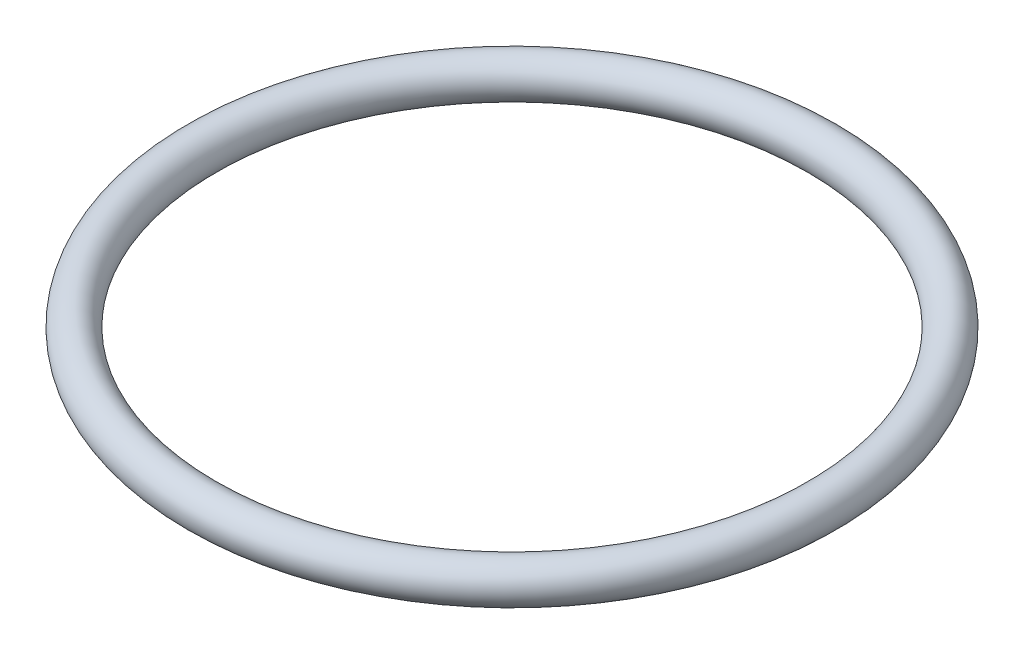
ISO-10303-21;
HEADER;
FILE_DESCRIPTION(('STEP AP214'),'2;1');
FILE_NAME('part.step','',(''),(''),'','','');
FILE_SCHEMA(('AUTOMOTIVE_DESIGN { 1 0 10303 214 1 1 1 1 }'));
ENDSEC;
DATA;
#1=APPLICATION_CONTEXT('core data for automotive mechanical design processes');
#2=APPLICATION_PROTOCOL_DEFINITION('international standard','automotive_design',2000,#1);
#3=PRODUCT_CONTEXT('',#1,'mechanical');
#4=PRODUCT('Part','Part','',(#3));
#5=PRODUCT_RELATED_PRODUCT_CATEGORY('part','',(#4));
#6=PRODUCT_DEFINITION_FORMATION('','',#4);
#7=PRODUCT_DEFINITION_CONTEXT('part definition',#1,'design');
#8=PRODUCT_DEFINITION('design','',#6,#7);
#9=PRODUCT_DEFINITION_SHAPE('','',#8);
#10=(LENGTH_UNIT() NAMED_UNIT(*) SI_UNIT(.MILLI.,.METRE.));
#11=(NAMED_UNIT(*) PLANE_ANGLE_UNIT() SI_UNIT($,.RADIAN.));
#12=(NAMED_UNIT(*) SI_UNIT($,.STERADIAN.) SOLID_ANGLE_UNIT());
#13=UNCERTAINTY_MEASURE_WITH_UNIT(LENGTH_MEASURE(1.E-05),#10,'distance_accuracy_value','');
#14=(GEOMETRIC_REPRESENTATION_CONTEXT(3) GLOBAL_UNCERTAINTY_ASSIGNED_CONTEXT((#13)) GLOBAL_UNIT_ASSIGNED_CONTEXT((#10,
#11,#12)) REPRESENTATION_CONTEXT('',''));
#15=CARTESIAN_POINT('',(0.,0.,0.));
#16=DIRECTION('',(0.,0.,1.));
#17=DIRECTION('',(1.,0.,0.));
#18=AXIS2_PLACEMENT_3D('',#15,#16,#17);
#19=CARTESIAN_POINT('',(0.,21.,0.));
#20=DIRECTION('',(0.,1.,0.));
#21=DIRECTION('',(0.,0.,1.));
#22=AXIS2_PLACEMENT_3D('',#19,#20,#21);
#23=TOROIDAL_SURFACE('',#22,11.75,0.750000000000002);
#24=CARTESIAN_POINT('',(0.,21.,12.5));
#25=VERTEX_POINT('',#24);
#26=VERTEX_LOOP('',#25);
#27=FACE_BOUND('',#26,.T.);
#28=ADVANCED_FACE('F24',(#27),#23,.T.);
#29=CLOSED_SHELL('',(#28));
#30=MANIFOLD_SOLID_BREP('B2',#29);
#31=ADVANCED_BREP_SHAPE_REPRESENTATION('',(#18,#30),#14);
#32=SHAPE_DEFINITION_REPRESENTATION(#9,#31);
ENDSEC;
END-ISO-10303-21;
